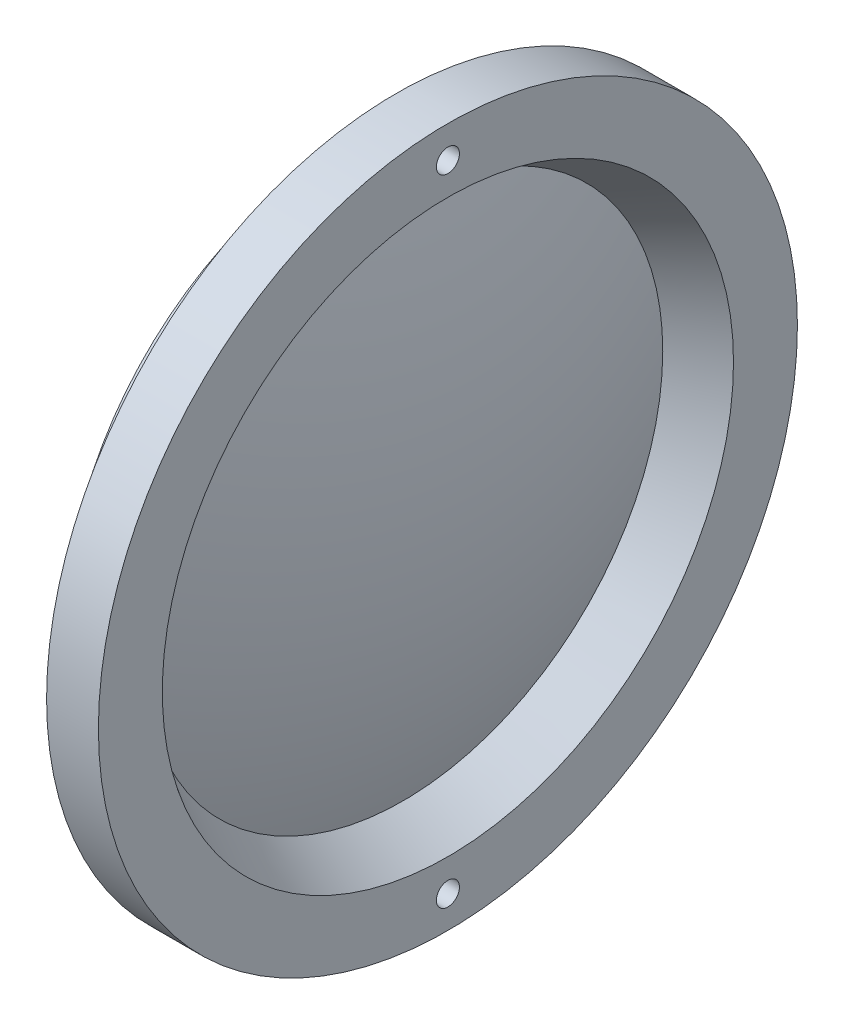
from build123d import *

# Parameters (mm, degrees)
SKETCH3_R          = 0.5
CUT_EXTRUDE1_DEPTH = 1


with BuildPart() as part:
    # Sketch1 → Revolve1 (revolve)
    with BuildSketch(Plane.XY, mode=Mode.PRIVATE) as revolve1_sk:
        with BuildLine():
            Line((4.5, 0), (1, 0))
            ThreePointArc((1, 0), (0.749567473, -6.020797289), (0, -12))
            Line((0, -12), (2.4, -12))
            ThreePointArc((2.4, -12), (3.971040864, -6.091182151), (4.5, 0))
        make_face()
    revolve(revolve1_sk.sketch.rotate(Axis((-7.215297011, 0, 0), (1, 0, 0)), 180), axis=Axis((-7.215297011, 0, 0), (1, 0, 0)))

    # Sketch2 → Revolve2 (revolve)
    with BuildSketch(Plane.XY, mode=Mode.PRIVATE) as revolve2_sk:
        with BuildLine():
            Line((2.35, 12), (2.4, 12))
            ThreePointArc((2.4, 12), (2.528417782, 11.638186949), (2.652896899, 11.275))
            Line((2.652896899, 11.275), (4.6, 12.399160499))
            Line((4.6, 12.399160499), (4.6, 15.175))
            Line((4.6, 15.175), (2.35, 15.175))
            Line((2.35, 15.175), (2.35, 12))
        make_face()
    revolve(revolve2_sk.sketch.rotate(Axis((0, 0, 0), (-1, 0, 0)), 90), axis=Axis((0, 0, 0), (-1, 0, 0)))

    # Sketch3 → Cut-Extrude1 (cut)
    with BuildSketch(Plane(origin=(4.6, 0, 0), x_dir=(0, 0, -1), z_dir=(1, 0, 0))):
        with Locations((0, -13.78708025)):
            Circle(SKETCH3_R)
        with Locations((0, 13.78708025)):
            Circle(SKETCH3_R)
    extrude(amount=-CUT_EXTRUDE1_DEPTH, mode=Mode.SUBTRACT)


solid = part.part
